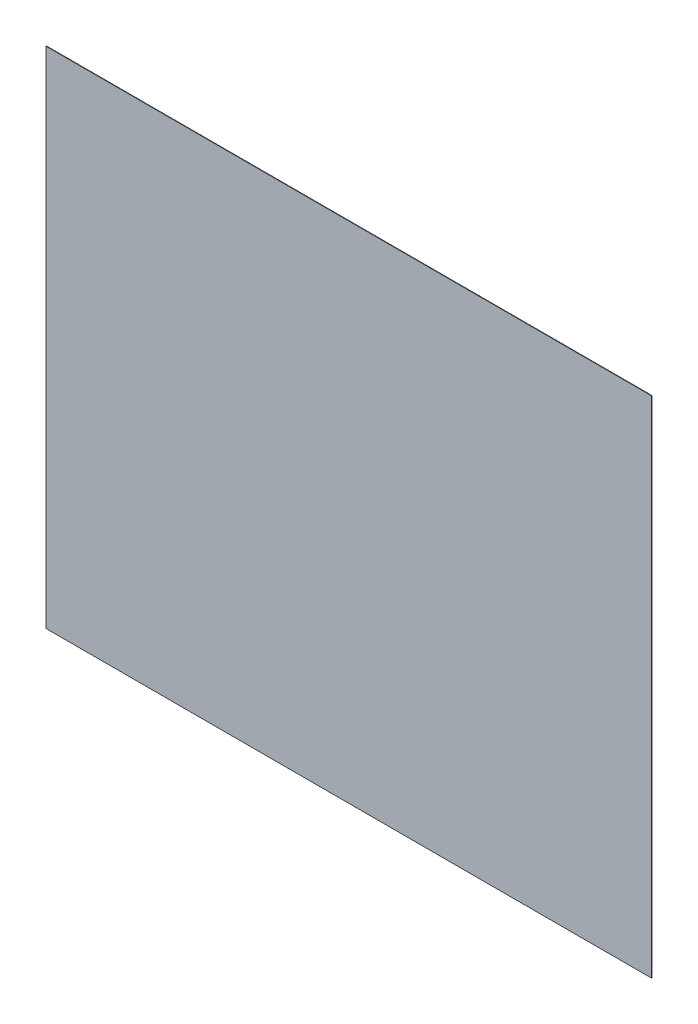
ISO-10303-21;
HEADER;
FILE_DESCRIPTION(('STEP AP214'),'2;1');
FILE_NAME('part.step','',(''),(''),'','','');
FILE_SCHEMA(('AUTOMOTIVE_DESIGN { 1 0 10303 214 1 1 1 1 }'));
ENDSEC;
DATA;
#1=APPLICATION_CONTEXT('core data for automotive mechanical design processes');
#2=APPLICATION_PROTOCOL_DEFINITION('international standard','automotive_design',2000,#1);
#3=PRODUCT_CONTEXT('',#1,'mechanical');
#4=PRODUCT('Part','Part','',(#3));
#5=PRODUCT_RELATED_PRODUCT_CATEGORY('part','',(#4));
#6=PRODUCT_DEFINITION_FORMATION('','',#4);
#7=PRODUCT_DEFINITION_CONTEXT('part definition',#1,'design');
#8=PRODUCT_DEFINITION('design','',#6,#7);
#9=PRODUCT_DEFINITION_SHAPE('','',#8);
#10=(LENGTH_UNIT() NAMED_UNIT(*) SI_UNIT(.MILLI.,.METRE.));
#11=(NAMED_UNIT(*) PLANE_ANGLE_UNIT() SI_UNIT($,.RADIAN.));
#12=(NAMED_UNIT(*) SI_UNIT($,.STERADIAN.) SOLID_ANGLE_UNIT());
#13=UNCERTAINTY_MEASURE_WITH_UNIT(LENGTH_MEASURE(1.E-05),#10,'distance_accuracy_value','');
#14=(GEOMETRIC_REPRESENTATION_CONTEXT(3) GLOBAL_UNCERTAINTY_ASSIGNED_CONTEXT((#13)) GLOBAL_UNIT_ASSIGNED_CONTEXT((#10,
#11,#12)) REPRESENTATION_CONTEXT('',''));
#15=CARTESIAN_POINT('',(0.,0.,0.));
#16=DIRECTION('',(0.,0.,1.));
#17=DIRECTION('',(1.,0.,0.));
#18=AXIS2_PLACEMENT_3D('',#15,#16,#17);
#19=CARTESIAN_POINT('',(0.,0.,0.01));
#20=DIRECTION('',(0.,0.,1.));
#21=DIRECTION('',(1.,0.,0.));
#22=AXIS2_PLACEMENT_3D('',#19,#20,#21);
#23=PLANE('',#22);
#24=DIRECTION('',(1.,0.,0.));
#25=VECTOR('',#24,1.);
#26=CARTESIAN_POINT('',(12.,10.,0.01));
#27=LINE('',#26,#25);
#28=CARTESIAN_POINT('',(0.,10.,0.01));
#29=VERTEX_POINT('',#28);
#30=CARTESIAN_POINT('',(12.,10.,0.01));
#31=VERTEX_POINT('',#30);
#32=EDGE_CURVE('E67',#29,#31,#27,.T.);
#33=ORIENTED_EDGE('',*,*,#32,.F.);
#34=DIRECTION('',(0.,1.,0.));
#35=VECTOR('',#34,1.);
#36=CARTESIAN_POINT('',(0.,10.,0.01));
#37=LINE('',#36,#35);
#38=CARTESIAN_POINT('',(0.,0.,0.01));
#39=VERTEX_POINT('',#38);
#40=EDGE_CURVE('E19',#39,#29,#37,.T.);
#41=ORIENTED_EDGE('',*,*,#40,.F.);
#42=DIRECTION('',(1.,0.,0.));
#43=VECTOR('',#42,1.);
#44=CARTESIAN_POINT('',(0.,0.,0.01));
#45=LINE('',#44,#43);
#46=CARTESIAN_POINT('',(12.,0.,0.01));
#47=VERTEX_POINT('',#46);
#48=EDGE_CURVE('E57',#47,#39,#45,.F.);
#49=ORIENTED_EDGE('',*,*,#48,.F.);
#50=DIRECTION('',(0.,1.,0.));
#51=VECTOR('',#50,1.);
#52=CARTESIAN_POINT('',(12.,0.,0.01));
#53=LINE('',#52,#51);
#54=EDGE_CURVE('E52',#31,#47,#53,.F.);
#55=ORIENTED_EDGE('',*,*,#54,.F.);
#56=EDGE_LOOP('',(#33,#41,#49,#55));
#57=FACE_BOUND('',#56,.T.);
#58=ADVANCED_FACE('F16',(#57),#23,.T.);
#59=CARTESIAN_POINT('',(0.,10.,0.));
#60=DIRECTION('',(-1.,0.,0.));
#61=DIRECTION('',(0.,0.,1.));
#62=AXIS2_PLACEMENT_3D('',#59,#60,#61);
#63=PLANE('',#62);
#64=DIRECTION('',(0.,0.,1.));
#65=VECTOR('',#64,1.);
#66=CARTESIAN_POINT('',(0.,10.,0.));
#67=LINE('',#66,#65);
#68=CARTESIAN_POINT('',(0.,10.,0.));
#69=VERTEX_POINT('',#68);
#70=EDGE_CURVE('E78',#69,#29,#67,.T.);
#71=ORIENTED_EDGE('',*,*,#70,.F.);
#72=DIRECTION('',(0.,1.,0.));
#73=VECTOR('',#72,1.);
#74=CARTESIAN_POINT('',(0.,0.,0.));
#75=LINE('',#74,#73);
#76=CARTESIAN_POINT('',(0.,0.,0.));
#77=VERTEX_POINT('',#76);
#78=EDGE_CURVE('E73',#69,#77,#75,.F.);
#79=ORIENTED_EDGE('',*,*,#78,.T.);
#80=DIRECTION('',(0.,0.,-1.));
#81=VECTOR('',#80,1.);
#82=CARTESIAN_POINT('',(0.,0.,0.));
#83=LINE('',#82,#81);
#84=EDGE_CURVE('E62',#39,#77,#83,.T.);
#85=ORIENTED_EDGE('',*,*,#84,.F.);
#86=ORIENTED_EDGE('',*,*,#40,.T.);
#87=EDGE_LOOP('',(#71,#79,#85,#86));
#88=FACE_BOUND('',#87,.T.);
#89=ADVANCED_FACE('F72',(#88),#63,.T.);
#90=CARTESIAN_POINT('',(0.,0.,0.));
#91=DIRECTION('',(0.,-1.,0.));
#92=DIRECTION('',(0.,0.,-1.));
#93=AXIS2_PLACEMENT_3D('',#90,#91,#92);
#94=PLANE('',#93);
#95=ORIENTED_EDGE('',*,*,#84,.T.);
#96=DIRECTION('',(1.,0.,0.));
#97=VECTOR('',#96,1.);
#98=CARTESIAN_POINT('',(0.,0.,0.));
#99=LINE('',#98,#97);
#100=CARTESIAN_POINT('',(12.,0.,0.));
#101=VERTEX_POINT('',#100);
#102=EDGE_CURVE('E83',#77,#101,#99,.T.);
#103=ORIENTED_EDGE('',*,*,#102,.T.);
#104=DIRECTION('',(0.,0.,-1.));
#105=VECTOR('',#104,1.);
#106=CARTESIAN_POINT('',(12.,0.,0.));
#107=LINE('',#106,#105);
#108=EDGE_CURVE('E64',#47,#101,#107,.T.);
#109=ORIENTED_EDGE('',*,*,#108,.F.);
#110=ORIENTED_EDGE('',*,*,#48,.T.);
#111=EDGE_LOOP('',(#95,#103,#109,#110));
#112=FACE_BOUND('',#111,.T.);
#113=ADVANCED_FACE('F59',(#112),#94,.T.);
#114=CARTESIAN_POINT('',(12.,0.,0.));
#115=DIRECTION('',(1.,0.,0.));
#116=DIRECTION('',(0.,0.,-1.));
#117=AXIS2_PLACEMENT_3D('',#114,#115,#116);
#118=PLANE('',#117);
#119=ORIENTED_EDGE('',*,*,#108,.T.);
#120=DIRECTION('',(0.,1.,0.));
#121=VECTOR('',#120,1.);
#122=CARTESIAN_POINT('',(12.,0.,0.));
#123=LINE('',#122,#121);
#124=CARTESIAN_POINT('',(12.,10.,0.));
#125=VERTEX_POINT('',#124);
#126=EDGE_CURVE('E25',#101,#125,#123,.T.);
#127=ORIENTED_EDGE('',*,*,#126,.T.);
#128=DIRECTION('',(0.,0.,1.));
#129=VECTOR('',#128,1.);
#130=CARTESIAN_POINT('',(12.,10.,0.));
#131=LINE('',#130,#129);
#132=EDGE_CURVE('E33',#31,#125,#131,.F.);
#133=ORIENTED_EDGE('',*,*,#132,.F.);
#134=ORIENTED_EDGE('',*,*,#54,.T.);
#135=EDGE_LOOP('',(#119,#127,#133,#134));
#136=FACE_BOUND('',#135,.T.);
#137=ADVANCED_FACE('F87',(#136),#118,.T.);
#138=CARTESIAN_POINT('',(12.,10.,0.));
#139=DIRECTION('',(0.,1.,0.));
#140=DIRECTION('',(0.,0.,1.));
#141=AXIS2_PLACEMENT_3D('',#138,#139,#140);
#142=PLANE('',#141);
#143=ORIENTED_EDGE('',*,*,#132,.T.);
#144=DIRECTION('',(1.,0.,0.));
#145=VECTOR('',#144,1.);
#146=CARTESIAN_POINT('',(0.,10.,0.));
#147=LINE('',#146,#145);
#148=EDGE_CURVE('E11',#125,#69,#147,.F.);
#149=ORIENTED_EDGE('',*,*,#148,.T.);
#150=ORIENTED_EDGE('',*,*,#70,.T.);
#151=ORIENTED_EDGE('',*,*,#32,.T.);
#152=EDGE_LOOP('',(#143,#149,#150,#151));
#153=FACE_BOUND('',#152,.T.);
#154=ADVANCED_FACE('F90',(#153),#142,.T.);
#155=CARTESIAN_POINT('',(0.,0.,0.));
#156=DIRECTION('',(0.,0.,1.));
#157=DIRECTION('',(1.,0.,0.));
#158=AXIS2_PLACEMENT_3D('',#155,#156,#157);
#159=PLANE('',#158);
#160=ORIENTED_EDGE('',*,*,#126,.F.);
#161=ORIENTED_EDGE('',*,*,#102,.F.);
#162=ORIENTED_EDGE('',*,*,#78,.F.);
#163=ORIENTED_EDGE('',*,*,#148,.F.);
#164=EDGE_LOOP('',(#160,#161,#162,#163));
#165=FACE_BOUND('',#164,.T.);
#166=ADVANCED_FACE('F89',(#165),#159,.F.);
#167=CLOSED_SHELL('',(#58,#89,#113,#137,#154,#166));
#168=MANIFOLD_SOLID_BREP('B1',#167);
#169=ADVANCED_BREP_SHAPE_REPRESENTATION('',(#18,#168),#14);
#170=SHAPE_DEFINITION_REPRESENTATION(#9,#169);
ENDSEC;
END-ISO-10303-21;
